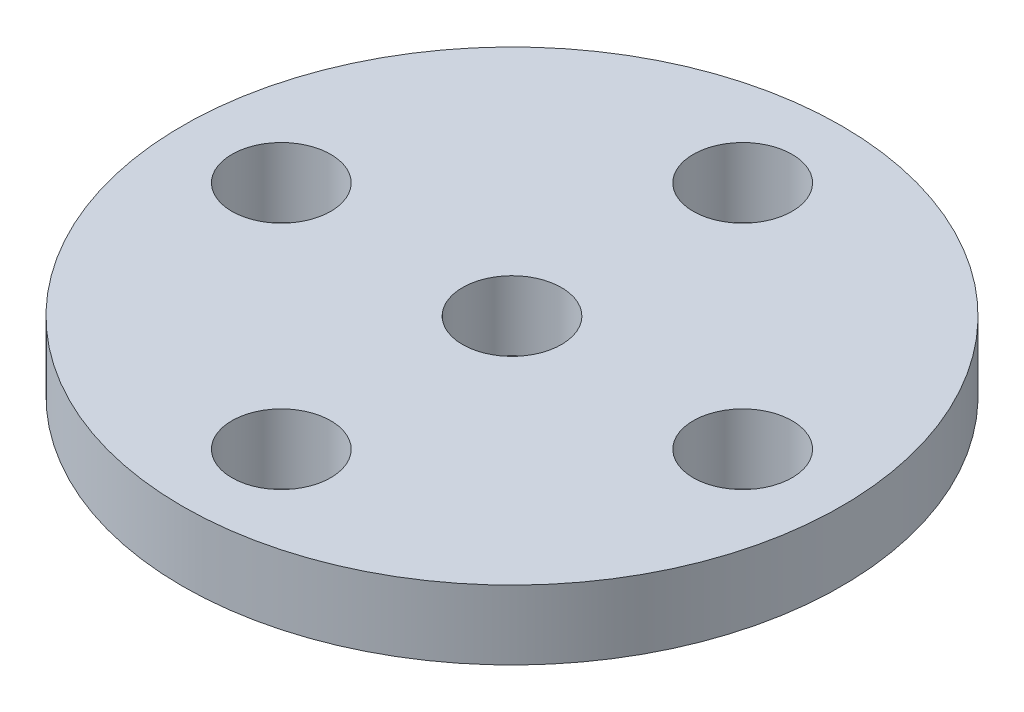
ISO-10303-21;
HEADER;
FILE_DESCRIPTION(('STEP AP214'),'2;1');
FILE_NAME('part.step','',(''),(''),'','','');
FILE_SCHEMA(('AUTOMOTIVE_DESIGN { 1 0 10303 214 1 1 1 1 }'));
ENDSEC;
DATA;
#1=APPLICATION_CONTEXT('core data for automotive mechanical design processes');
#2=APPLICATION_PROTOCOL_DEFINITION('international standard','automotive_design',2000,#1);
#3=PRODUCT_CONTEXT('',#1,'mechanical');
#4=PRODUCT('Part','Part','',(#3));
#5=PRODUCT_RELATED_PRODUCT_CATEGORY('part','',(#4));
#6=PRODUCT_DEFINITION_FORMATION('','',#4);
#7=PRODUCT_DEFINITION_CONTEXT('part definition',#1,'design');
#8=PRODUCT_DEFINITION('design','',#6,#7);
#9=PRODUCT_DEFINITION_SHAPE('','',#8);
#10=(LENGTH_UNIT() NAMED_UNIT(*) SI_UNIT(.MILLI.,.METRE.));
#11=(NAMED_UNIT(*) PLANE_ANGLE_UNIT() SI_UNIT($,.RADIAN.));
#12=(NAMED_UNIT(*) SI_UNIT($,.STERADIAN.) SOLID_ANGLE_UNIT());
#13=UNCERTAINTY_MEASURE_WITH_UNIT(LENGTH_MEASURE(1.E-05),#10,'distance_accuracy_value','');
#14=(GEOMETRIC_REPRESENTATION_CONTEXT(3) GLOBAL_UNCERTAINTY_ASSIGNED_CONTEXT((#13)) GLOBAL_UNIT_ASSIGNED_CONTEXT((#10,
#11,#12)) REPRESENTATION_CONTEXT('',''));
#15=CARTESIAN_POINT('',(0.,0.,0.));
#16=DIRECTION('',(0.,0.,1.));
#17=DIRECTION('',(1.,0.,0.));
#18=AXIS2_PLACEMENT_3D('',#15,#16,#17);
#19=CARTESIAN_POINT('',(0.,2.1,0.));
#20=DIRECTION('',(0.,1.,0.));
#21=DIRECTION('',(0.,0.,1.));
#22=AXIS2_PLACEMENT_3D('',#19,#20,#21);
#23=PLANE('',#22);
#24=CARTESIAN_POINT('',(3.96374205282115E-13,2.1,7.));
#25=DIRECTION('',(0.,1.,0.));
#26=DIRECTION('',(0.,0.,1.));
#27=AXIS2_PLACEMENT_3D('',#24,#25,#26);
#28=CIRCLE('',#27,1.50000000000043);
#29=CARTESIAN_POINT('',(3.96374205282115E-13,2.1,8.50000000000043));
#30=VERTEX_POINT('',#29);
#31=EDGE_CURVE('E71',#30,#30,#28,.T.);
#32=ORIENTED_EDGE('',*,*,#31,.F.);
#33=EDGE_LOOP('',(#32));
#34=FACE_BOUND('',#33,.T.);
#35=CARTESIAN_POINT('',(0.,2.1,-7.));
#36=DIRECTION('',(0.,1.,0.));
#37=DIRECTION('',(0.,0.,1.));
#38=AXIS2_PLACEMENT_3D('',#35,#36,#37);
#39=CIRCLE('',#38,1.5);
#40=CARTESIAN_POINT('',(0.,2.1,-5.5));
#41=VERTEX_POINT('',#40);
#42=EDGE_CURVE('E59',#41,#41,#39,.T.);
#43=ORIENTED_EDGE('',*,*,#42,.F.);
#44=EDGE_LOOP('',(#43));
#45=FACE_BOUND('',#44,.T.);
#46=CARTESIAN_POINT('',(0.,2.1,0.));
#47=DIRECTION('',(0.,1.,0.));
#48=DIRECTION('',(0.,0.,1.));
#49=AXIS2_PLACEMENT_3D('',#46,#47,#48);
#50=CIRCLE('',#49,10.);
#51=CARTESIAN_POINT('',(0.,2.1,10.));
#52=VERTEX_POINT('',#51);
#53=EDGE_CURVE('E12',#52,#52,#50,.T.);
#54=ORIENTED_EDGE('',*,*,#53,.T.);
#55=EDGE_LOOP('',(#54));
#56=FACE_BOUND('',#55,.T.);
#57=CARTESIAN_POINT('',(0.,2.1,0.));
#58=DIRECTION('',(0.,1.,0.));
#59=DIRECTION('',(0.,0.,1.));
#60=AXIS2_PLACEMENT_3D('',#57,#58,#59);
#61=CIRCLE('',#60,1.5);
#62=CARTESIAN_POINT('',(0.,2.1,1.5));
#63=VERTEX_POINT('',#62);
#64=EDGE_CURVE('E54',#63,#63,#61,.T.);
#65=ORIENTED_EDGE('',*,*,#64,.F.);
#66=EDGE_LOOP('',(#65));
#67=FACE_BOUND('',#66,.T.);
#68=CARTESIAN_POINT('',(7.0000000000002,2.1,-1.98094713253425E-13));
#69=DIRECTION('',(0.,1.,0.));
#70=DIRECTION('',(0.,0.,1.));
#71=AXIS2_PLACEMENT_3D('',#68,#69,#70);
#72=CIRCLE('',#71,1.50000000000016);
#73=CARTESIAN_POINT('',(7.0000000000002,2.1,1.49999999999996));
#74=VERTEX_POINT('',#73);
#75=EDGE_CURVE('E65',#74,#74,#72,.T.);
#76=ORIENTED_EDGE('',*,*,#75,.F.);
#77=EDGE_LOOP('',(#76));
#78=FACE_BOUND('',#77,.T.);
#79=CARTESIAN_POINT('',(-6.9999999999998,2.1,1.98951966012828E-13));
#80=DIRECTION('',(0.,1.,0.));
#81=DIRECTION('',(0.,0.,1.));
#82=AXIS2_PLACEMENT_3D('',#79,#80,#81);
#83=CIRCLE('',#82,1.50000000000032);
#84=CARTESIAN_POINT('',(-6.9999999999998,2.1,1.50000000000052));
#85=VERTEX_POINT('',#84);
#86=EDGE_CURVE('E77',#85,#85,#83,.T.);
#87=ORIENTED_EDGE('',*,*,#86,.F.);
#88=EDGE_LOOP('',(#87));
#89=FACE_BOUND('',#88,.T.);
#90=ADVANCED_FACE('F43',(#34,#45,#56,#67,#78,#89),#23,.T.);
#91=CARTESIAN_POINT('',(0.,0.,0.));
#92=DIRECTION('',(0.,1.,0.));
#93=DIRECTION('',(0.,0.,1.));
#94=AXIS2_PLACEMENT_3D('',#91,#92,#93);
#95=PLANE('',#94);
#96=CARTESIAN_POINT('',(0.,0.,0.));
#97=DIRECTION('',(0.,1.,0.));
#98=DIRECTION('',(0.,0.,1.));
#99=AXIS2_PLACEMENT_3D('',#96,#97,#98);
#100=CIRCLE('',#99,10.);
#101=CARTESIAN_POINT('',(0.,0.,10.));
#102=VERTEX_POINT('',#101);
#103=EDGE_CURVE('E47',#102,#102,#100,.T.);
#104=ORIENTED_EDGE('',*,*,#103,.F.);
#105=EDGE_LOOP('',(#104));
#106=FACE_BOUND('',#105,.T.);
#107=CARTESIAN_POINT('',(0.,0.,0.));
#108=DIRECTION('',(0.,1.,0.));
#109=DIRECTION('',(0.,0.,1.));
#110=AXIS2_PLACEMENT_3D('',#107,#108,#109);
#111=CIRCLE('',#110,1.5);
#112=CARTESIAN_POINT('',(0.,0.,1.5));
#113=VERTEX_POINT('',#112);
#114=EDGE_CURVE('E56',#113,#113,#111,.T.);
#115=ORIENTED_EDGE('',*,*,#114,.T.);
#116=EDGE_LOOP('',(#115));
#117=FACE_BOUND('',#116,.T.);
#118=CARTESIAN_POINT('',(0.,0.,-7.));
#119=DIRECTION('',(0.,1.,0.));
#120=DIRECTION('',(0.,0.,1.));
#121=AXIS2_PLACEMENT_3D('',#118,#119,#120);
#122=CIRCLE('',#121,1.5);
#123=CARTESIAN_POINT('',(0.,0.,-5.5));
#124=VERTEX_POINT('',#123);
#125=EDGE_CURVE('E62',#124,#124,#122,.T.);
#126=ORIENTED_EDGE('',*,*,#125,.T.);
#127=EDGE_LOOP('',(#126));
#128=FACE_BOUND('',#127,.T.);
#129=CARTESIAN_POINT('',(7.0000000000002,0.,-1.98094713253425E-13));
#130=DIRECTION('',(0.,1.,0.));
#131=DIRECTION('',(0.,0.,1.));
#132=AXIS2_PLACEMENT_3D('',#129,#130,#131);
#133=CIRCLE('',#132,1.50000000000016);
#134=CARTESIAN_POINT('',(7.0000000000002,0.,1.49999999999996));
#135=VERTEX_POINT('',#134);
#136=EDGE_CURVE('E68',#135,#135,#133,.T.);
#137=ORIENTED_EDGE('',*,*,#136,.T.);
#138=EDGE_LOOP('',(#137));
#139=FACE_BOUND('',#138,.T.);
#140=CARTESIAN_POINT('',(3.96374205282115E-13,0.,7.));
#141=DIRECTION('',(0.,1.,0.));
#142=DIRECTION('',(0.,0.,1.));
#143=AXIS2_PLACEMENT_3D('',#140,#141,#142);
#144=CIRCLE('',#143,1.50000000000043);
#145=CARTESIAN_POINT('',(3.96374205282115E-13,0.,8.50000000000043));
#146=VERTEX_POINT('',#145);
#147=EDGE_CURVE('E74',#146,#146,#144,.T.);
#148=ORIENTED_EDGE('',*,*,#147,.T.);
#149=EDGE_LOOP('',(#148));
#150=FACE_BOUND('',#149,.T.);
#151=CARTESIAN_POINT('',(-6.9999999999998,0.,1.98951966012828E-13));
#152=DIRECTION('',(0.,1.,0.));
#153=DIRECTION('',(0.,0.,1.));
#154=AXIS2_PLACEMENT_3D('',#151,#152,#153);
#155=CIRCLE('',#154,1.50000000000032);
#156=CARTESIAN_POINT('',(-6.9999999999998,0.,1.50000000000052));
#157=VERTEX_POINT('',#156);
#158=EDGE_CURVE('E80',#157,#157,#155,.T.);
#159=ORIENTED_EDGE('',*,*,#158,.T.);
#160=EDGE_LOOP('',(#159));
#161=FACE_BOUND('',#160,.T.);
#162=ADVANCED_FACE('F90',(#106,#117,#128,#139,#150,#161),#95,.F.);
#163=CARTESIAN_POINT('',(0.,2.1,0.));
#164=DIRECTION('',(0.,-1.,0.));
#165=DIRECTION('',(0.,0.,-1.));
#166=AXIS2_PLACEMENT_3D('',#163,#164,#165);
#167=CYLINDRICAL_SURFACE('',#166,10.);
#168=ORIENTED_EDGE('',*,*,#53,.F.);
#169=EDGE_LOOP('',(#168));
#170=FACE_BOUND('',#169,.T.);
#171=ORIENTED_EDGE('',*,*,#103,.T.);
#172=EDGE_LOOP('',(#171));
#173=FACE_BOUND('',#172,.T.);
#174=ADVANCED_FACE('F45',(#170,#173),#167,.T.);
#175=CARTESIAN_POINT('',(0.,2.1,0.));
#176=DIRECTION('',(0.,-1.,0.));
#177=DIRECTION('',(0.,0.,-1.));
#178=AXIS2_PLACEMENT_3D('',#175,#176,#177);
#179=CYLINDRICAL_SURFACE('',#178,1.5);
#180=ORIENTED_EDGE('',*,*,#64,.T.);
#181=EDGE_LOOP('',(#180));
#182=FACE_BOUND('',#181,.T.);
#183=ORIENTED_EDGE('',*,*,#114,.F.);
#184=EDGE_LOOP('',(#183));
#185=FACE_BOUND('',#184,.T.);
#186=ADVANCED_FACE('F100',(#182,#185),#179,.F.);
#187=CARTESIAN_POINT('',(0.,2.1,-7.));
#188=DIRECTION('',(0.,-1.,0.));
#189=DIRECTION('',(0.,0.,-1.));
#190=AXIS2_PLACEMENT_3D('',#187,#188,#189);
#191=CYLINDRICAL_SURFACE('',#190,1.5);
#192=ORIENTED_EDGE('',*,*,#42,.T.);
#193=EDGE_LOOP('',(#192));
#194=FACE_BOUND('',#193,.T.);
#195=ORIENTED_EDGE('',*,*,#125,.F.);
#196=EDGE_LOOP('',(#195));
#197=FACE_BOUND('',#196,.T.);
#198=ADVANCED_FACE('F103',(#194,#197),#191,.F.);
#199=CARTESIAN_POINT('',(7.0000000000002,2.1,-1.98094713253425E-13));
#200=DIRECTION('',(0.,-1.,0.));
#201=DIRECTION('',(0.,0.,-1.));
#202=AXIS2_PLACEMENT_3D('',#199,#200,#201);
#203=CYLINDRICAL_SURFACE('',#202,1.50000000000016);
#204=ORIENTED_EDGE('',*,*,#75,.T.);
#205=EDGE_LOOP('',(#204));
#206=FACE_BOUND('',#205,.T.);
#207=ORIENTED_EDGE('',*,*,#136,.F.);
#208=EDGE_LOOP('',(#207));
#209=FACE_BOUND('',#208,.T.);
#210=ADVANCED_FACE('F107',(#206,#209),#203,.F.);
#211=CARTESIAN_POINT('',(3.96374205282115E-13,2.1,7.));
#212=DIRECTION('',(0.,-1.,0.));
#213=DIRECTION('',(0.,0.,-1.));
#214=AXIS2_PLACEMENT_3D('',#211,#212,#213);
#215=CYLINDRICAL_SURFACE('',#214,1.50000000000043);
#216=ORIENTED_EDGE('',*,*,#31,.T.);
#217=EDGE_LOOP('',(#216));
#218=FACE_BOUND('',#217,.T.);
#219=ORIENTED_EDGE('',*,*,#147,.F.);
#220=EDGE_LOOP('',(#219));
#221=FACE_BOUND('',#220,.T.);
#222=ADVANCED_FACE('F111',(#218,#221),#215,.F.);
#223=CARTESIAN_POINT('',(-6.9999999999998,2.1,1.98951966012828E-13));
#224=DIRECTION('',(0.,-1.,0.));
#225=DIRECTION('',(0.,0.,-1.));
#226=AXIS2_PLACEMENT_3D('',#223,#224,#225);
#227=CYLINDRICAL_SURFACE('',#226,1.50000000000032);
#228=ORIENTED_EDGE('',*,*,#86,.T.);
#229=EDGE_LOOP('',(#228));
#230=FACE_BOUND('',#229,.T.);
#231=ORIENTED_EDGE('',*,*,#158,.F.);
#232=EDGE_LOOP('',(#231));
#233=FACE_BOUND('',#232,.T.);
#234=ADVANCED_FACE('F86',(#230,#233),#227,.F.);
#235=CLOSED_SHELL('',(#90,#162,#174,#186,#198,#210,#222,#234));
#236=MANIFOLD_SOLID_BREP('B2',#235);
#237=ADVANCED_BREP_SHAPE_REPRESENTATION('',(#18,#236),#14);
#238=SHAPE_DEFINITION_REPRESENTATION(#9,#237);
ENDSEC;
END-ISO-10303-21;
